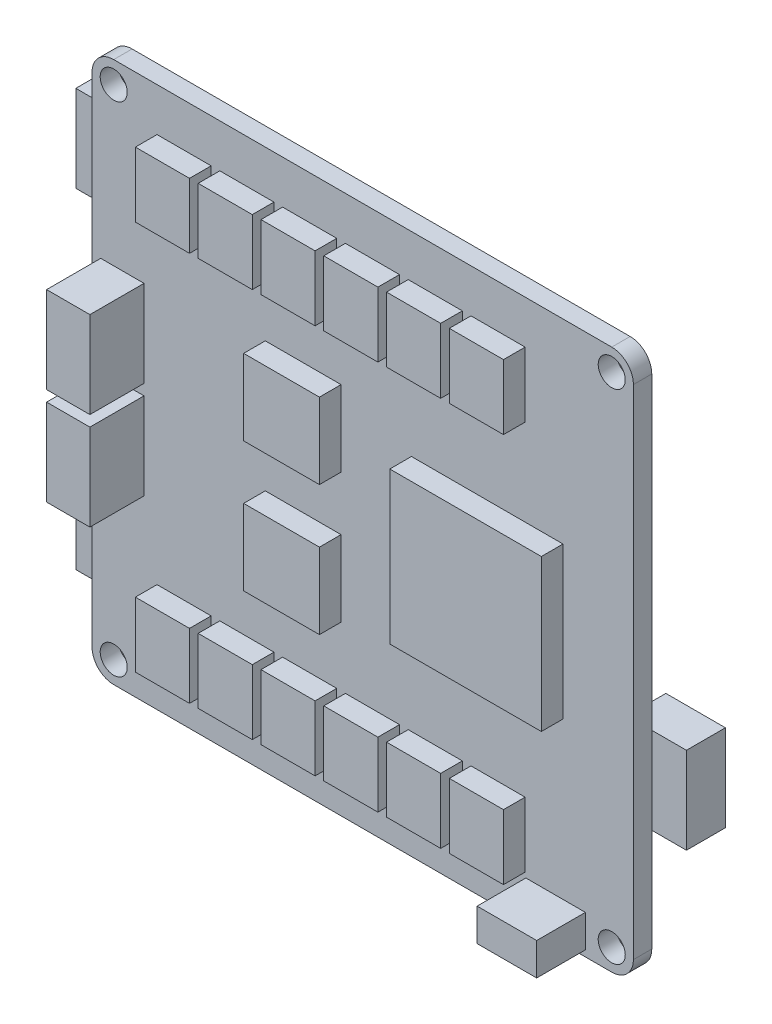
from build123d import *

# Parameters (mm, degrees)
SKIZZE1_W                       = 50
SKIZZE1_H                       = 50
SKIZZE1_R                       = 1.25
AUFSATZ_LINEAR_AUSTRAGEN1_DEPTH = 1.7
VERRUNDUNG1_R                   = 2
SKIZZE2_W                       = 14
SKIZZE2_H                       = 14
SKIZZE2_W_2                     = 7
SKIZZE2_H_2                     = 7
SKIZZE2_W_3                     = 5
SKIZZE2_H_3                     = 6
AUFSATZ_LINEAR_AUSTRAGEN2_DEPTH = 2
SKIZZE3_W                       = 4
SKIZZE3_H                       = 8
AUFSATZ_LINEAR_AUSTRAGEN3_DEPTH = 5
SKIZZE5_W                       = 5.5
SKIZZE5_H                       = 3
AUFSATZ_LINEAR_AUSTRAGEN5_DEPTH = 4.5
SKIZZE6_W                       = 5.5
SKIZZE6_H                       = 8
AUFSATZ_LINEAR_AUSTRAGEN6_DEPTH = 3.6


with BuildPart() as part:
    # Skizze1 → Aufsatz-Linear austragen1 (new body)
    with BuildSketch(Plane.XY):
        Rectangle(SKIZZE1_W, SKIZZE1_H)
        with Locations((-23, 23)):
            Circle(SKIZZE1_R, mode=Mode.SUBTRACT)
        with Locations(Location((23, 23, 0), (0, 0, 180))):
            Circle(SKIZZE1_R, mode=Mode.SUBTRACT)
        with Locations((23, -23)):
            Circle(SKIZZE1_R, mode=Mode.SUBTRACT)
        with Locations(Location((-23, -23, 0), (0, 0, 180))):
            Circle(SKIZZE1_R, mode=Mode.SUBTRACT)
    extrude(amount=AUFSATZ_LINEAR_AUSTRAGEN1_DEPTH)

    # Verrundung1
    verrundung1_edges = [part.edges().sort_by_distance(p)[0] for p in [
        (25, 25, 0.85),
        (25, -25, 0.85),
        (-25, -25, 0.85),
        (-25, 25, 0.85),
    ]]
    fillet(verrundung1_edges, radius=VERRUNDUNG1_R)

    # Skizze2 → Aufsatz-Linear austragen2 (add)
    with BuildSketch(Plane.XY.offset(1.7)):
        with Locations((11.5, 0)):
            Rectangle(SKIZZE2_W, SKIZZE2_H)
        with Locations((-5.5, 6)):
            Rectangle(SKIZZE2_W_2, SKIZZE2_H_2)
        with Locations((-5.5, -6)):
            Rectangle(SKIZZE2_W_2, SKIZZE2_H_2)
        with Locations((-10.7, 18)):
            Rectangle(SKIZZE2_W_3, SKIZZE2_H_3)
        with Locations((-16.5, 18)):
            Rectangle(SKIZZE2_W_3, SKIZZE2_H_3)
        with Locations((-4.9, 18)):
            Rectangle(SKIZZE2_W_3, SKIZZE2_H_3)
        with Locations((0.9, 18)):
            Rectangle(SKIZZE2_W_3, SKIZZE2_H_3)
        with Locations((6.7, 18)):
            Rectangle(SKIZZE2_W_3, SKIZZE2_H_3)
        with Locations((12.5, 18)):
            Rectangle(SKIZZE2_W_3, SKIZZE2_H_3)
        with Locations((12.5, -18)):
            Rectangle(SKIZZE2_W_3, SKIZZE2_H_3)
        with Locations((6.7, -18)):
            Rectangle(SKIZZE2_W_3, SKIZZE2_H_3)
        with Locations((0.9, -18)):
            Rectangle(SKIZZE2_W_3, SKIZZE2_H_3)
        with Locations((-4.9, -18)):
            Rectangle(SKIZZE2_W_3, SKIZZE2_H_3)
        with Locations((-10.7, -18)):
            Rectangle(SKIZZE2_W_3, SKIZZE2_H_3)
        with Locations((-16.5, -18)):
            Rectangle(SKIZZE2_W_3, SKIZZE2_H_3)
    extrude(amount=AUFSATZ_LINEAR_AUSTRAGEN2_DEPTH)

    # Skizze3 → Aufsatz-Linear austragen3 (add)
    with BuildSketch(Plane.XY.offset(1.7)):
        with Locations((-22.2, -4.5)):
            Rectangle(SKIZZE3_W, SKIZZE3_H)
        with Locations((-22.2, 4.5)):
            Rectangle(SKIZZE3_W, SKIZZE3_H)
    extrude(amount=AUFSATZ_LINEAR_AUSTRAGEN3_DEPTH)

    # Skizze5 → Aufsatz-Linear austragen5 (add)
    with BuildSketch(Plane.XY.offset(1.7)):
        with Locations((17.817192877, -22.933750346)):
            Rectangle(SKIZZE5_W, SKIZZE5_H)
    extrude(amount=AUFSATZ_LINEAR_AUSTRAGEN5_DEPTH)

    # Skizze6 → Aufsatz-Linear austragen6 (add)
    with BuildSketch(Plane(origin=(0, 0, 0), x_dir=(-1, 0, 0), z_dir=(0, 0, -1))):
        with Locations((25.45, 15.25)):
            Rectangle(SKIZZE6_W, SKIZZE6_H)
        with Locations((25.45, -15.25)):
            Rectangle(SKIZZE6_W, SKIZZE6_H)
        with Locations((-25.45, -9.5)):
            Rectangle(SKIZZE6_W, SKIZZE6_H)
    extrude(amount=AUFSATZ_LINEAR_AUSTRAGEN6_DEPTH)


solid = part.part
